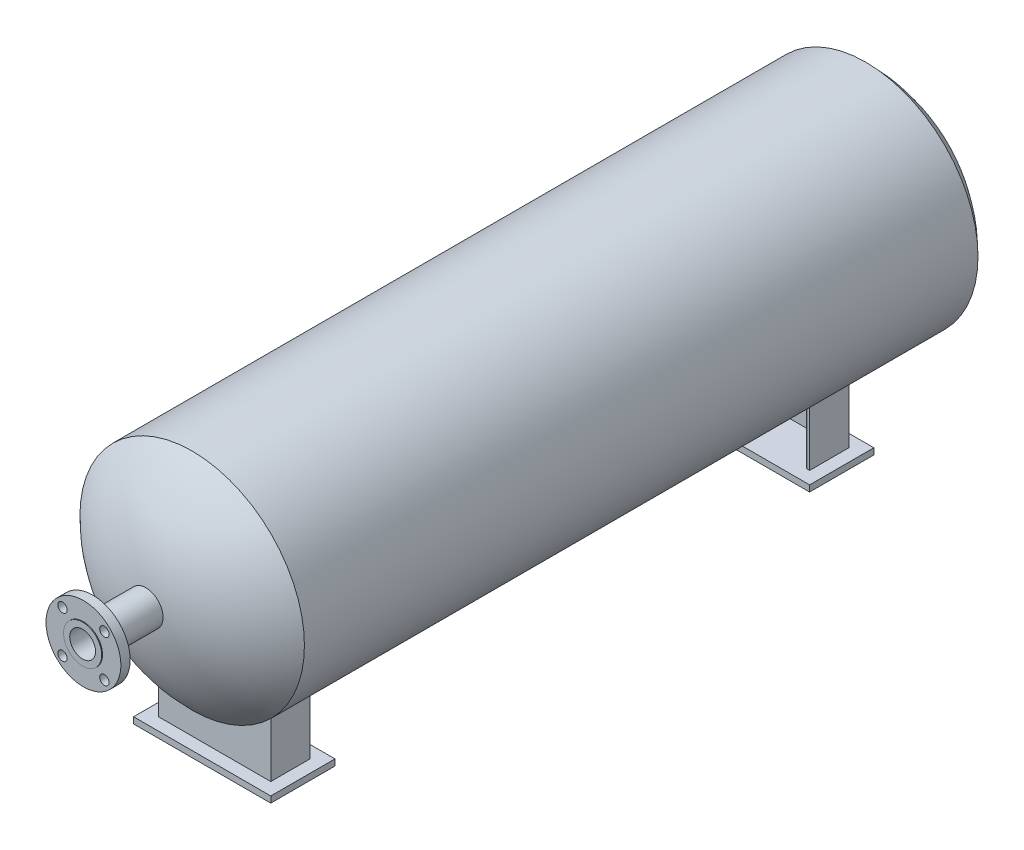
from build123d import *

# Parameters (mm, degrees)
BOSS_EXTRUDE1_DEPTH       = 177.8
SCALE1_SCALE              = 1.8
BOLT_HOLE_REACH           = 1826.188
BOLT_CIRCLE_SKETCH_R      = 9.525
BOLT_CIRCLE_PATTERN_COUNT = 4
SKETCH9_W                 = 279.400004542
SKETCH9_H                 = 130.81
BOSS_EXTRUDE2_DEPTH       = 12.7


with BuildPart() as part:
    # Sketch1 → Revolve1 (revolve)
    with BuildSketch(Plane(origin=(0, 0, 0), x_dir=(1, 0, 0), z_dir=(0, 1, 0))):
        with BuildLine():
            Line((-127, 381), (-127, -381))
            ThreePointArc((-127, -381), (-68.87837384, -420.482392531), (0, -434.365921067))
            Line((0, -434.365921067), (0, 434.365921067))
            ThreePointArc((0, 434.365921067), (-68.87837384, 420.482392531), (-127, 381))
        make_face()
    revolve(axis=Axis((0, 0, -434.365921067), (0, 0, 1)))

    # Sketch5 → Boss-Extrude1 (add)
    with BuildSketch(Plane(origin=(85.725, 0, -41.275), x_dir=(0, 0, -1), z_dir=(0, 1, 0))):
        with BuildLine():
            Line((-396.875, 22.225), (-396.875, 149.225))
            Line((-396.875, 149.225), (-352.425, 149.225))
            Line((-352.425, 149.225), (-352.425, 146.76608558))
            ThreePointArc((-352.425, 146.76608558), (-353.087111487, 144.96012673), (-354.759636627, 144.010106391))
            Line((-354.759636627, 144.010106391), (-385.894048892, 138.820659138))
            ThreePointArc((-385.894048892, 138.820659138), (-390.303433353, 136.316060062), (-392.049, 131.554895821))
            Line((-392.049, 131.554895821), (-392.049, 39.895104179))
            ThreePointArc((-392.049, 39.895104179), (-390.303433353, 35.133939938), (-385.894048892, 32.629340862))
            Line((-385.894048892, 32.629340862), (-354.759636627, 27.439893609))
            ThreePointArc((-354.759636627, 27.439893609), (-353.087111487, 26.48987327), (-352.425, 24.68391442))
            Line((-352.425, 24.68391442), (-352.425, 22.225))
            Line((-352.425, 22.225), (-396.875, 22.225))
        make_face()
        with BuildLine():
            Line((246.194048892, 32.629340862), (215.059636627, 27.439893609))
            ThreePointArc((215.059636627, 27.439893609), (213.387111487, 26.48987327), (212.725, 24.68391442))
            Line((212.725, 24.68391442), (212.725, 22.225))
            Line((212.725, 22.225), (257.175, 22.225))
            Line((257.175, 22.225), (257.175, 149.225))
            Line((257.175, 149.225), (212.725, 149.225))
            Line((212.725, 149.225), (212.725, 146.76608558))
            ThreePointArc((212.725, 146.76608558), (213.387111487, 144.96012673), (215.059636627, 144.010106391))
            Line((215.059636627, 144.010106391), (246.194048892, 138.820659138))
            ThreePointArc((246.194048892, 138.820659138), (250.603433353, 136.316060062), (252.349, 131.554895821))
            Line((252.349, 131.554895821), (252.349, 39.895104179))
            ThreePointArc((252.349, 39.895104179), (250.603433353, 35.133939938), (246.194048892, 32.629340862))
        make_face()
    extrude(amount=-BOSS_EXTRUDE1_DEPTH)


with BuildPart() as part_1:
    # Scale1: scaled about (-4.47e-07, -0.547470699, 0.106411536)
    add(part.part.scale(SCALE1_SCALE).moved(Location((3.58e-07, 0.437976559, -0.085129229))))

    # Nozzle_sketch → Nozzle_Body (revolve)
    with BuildSketch(Plane(origin=(0, -414.8245984, 380.90954241), x_dir=(0, 0, -1), z_dir=(1, 0, 0)), mode=Mode.PRIVATE) as nozzle_body_sk:
        Polygon((-527.863978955, 388.5101984), (-527.863978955, 375.9625984), (-526.276478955, 375.9625984), (-526.276478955, 338.6245984), (-507.226478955, 338.6245984), (-507.226478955, 379.8741984), (380.90954241, 379.8741984), (380.90954241, 388.5101984), align=None)
    revolve(nozzle_body_sk.sketch.rotate(Axis((0, 0, 0), (0, 0, 1)), 270), axis=Axis((0, 0, 0), (0, 0, 1)))

    # Bolt_circle_sketch → Bolt_hole (cut, up to next)
    with BuildSketch(Plane(origin=(0, 330.2, 907.186021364), x_dir=(-1, 0, 0), z_dir=(0, 0, 1)), mode=Mode.PRIVATE) as bolt_hole_sk1:
        with Locations(Location((42.656216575, 372.856216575, 0), (0, 0, 180))):
            Circle(BOLT_CIRCLE_SKETCH_R)
    bolt_hole_tool1 = extrude(bolt_hole_sk1.sketch, amount=-BOLT_HOLE_REACH, mode=Mode.PRIVATE) & part_1.part
    bolt_hole = bolt_hole_tool1.solids().sort_by_distance((-42.656217, -42.656217, 907.186021))[0]
    add(bolt_hole, mode=Mode.SUBTRACT)

    # Bolt_Circle_Pattern: Bolt_hole ×4 about axis
    bolt_circle_pattern_axis = Axis((0, 0, 0), (0, 0, 1))
    for i in range(1, BOLT_CIRCLE_PATTERN_COUNT):
        add(bolt_hole.rotate(bolt_circle_pattern_axis, i * 360 / BOLT_CIRCLE_PATTERN_COUNT), mode=Mode.SUBTRACT)

    # Sketch9 → Boss-Extrude2 (add)
    with BuildSketch(Plane.XZ.offset(319.601974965)):
        with Locations((0, 599.989863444)):
            Rectangle(SKETCH9_W, SKETCH9_H)
        with Locations((0, -497.290136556)):
            Rectangle(SKETCH9_W, SKETCH9_H)
    extrude(amount=BOSS_EXTRUDE2_DEPTH)


solid = part_1.part
